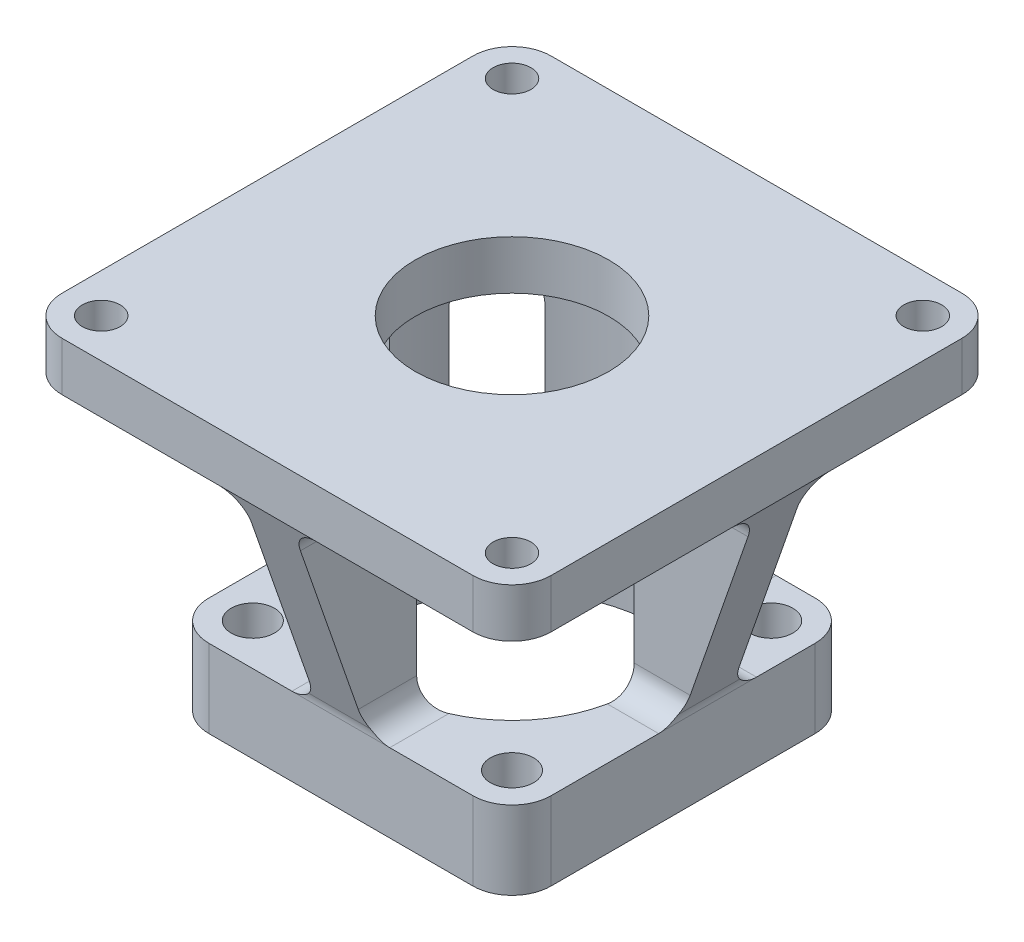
from build123d import *

# Parameters (mm, degrees)
SKETCH1_W                      = 63.5
SKETCH1_H                      = 63.5
SKETCH1_R                      = 15.875
BOSS_EXTRUDE1_DEPTH            = 44.45
F_2_0_221_DIAMETER_HOLE1_D     = 5.6134
F_2_0_221_DIAMETER_HOLE1_DEPTH = 12.7
F_2_0_221_DIAMETER_HOLE1_TIP   = 1.686435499
SKETCH7_W                      = 28.575
SKETCH7_H                      = 27.94
CUT_EXTRUDE1_DEPTH             = 31.74746
FILLET1_R                      = 3.175
FILLET1_OF_MIRROR1_R           = 3.175
SKETCH14_W                     = 22.86
SKETCH14_H                     = 27.94
CUT_EXTRUDE8_DEPTH             = 25.40254
FILLET5_R                      = 3.175
FILLET5_OF_MIRROR4_R           = 3.175
CUT_EXTRUDE7_DEPTH             = 84.762253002
CIRPATTERN1_COUNT              = 4
FILLET6_R                      = 5.08
SKETCH16_R                     = 19.0627
SKETCH16_R_2                   = 15.875
CUT_EXTRUDE10_DEPTH            = 7.62
BOSS_EXTRUDE2_START            = -6.35
SKETCH17_R                     = 15.875
SKETCH17_R_2                   = 12.5635
BOSS_EXTRUDE2_DEPTH            = 6.35
F_10_0_1935_DIAMETER_HOLE1_D   = 4.9149


with BuildPart() as part:
    # Sketch1 → Boss-Extrude1 (new body)
    with BuildSketch(Plane(origin=(0, 0, 0), x_dir=(1, 0, 0), z_dir=(0, 1, 0))):
        Rectangle(SKETCH1_W, SKETCH1_H)
        with Locations(Location((0, 0, 0), (0, 0, 270))):
            Circle(SKETCH1_R, mode=Mode.SUBTRACT)
    extrude(amount=BOSS_EXTRUDE1_DEPTH)

    # 2 _0.221_ Diameter Hole1
    with Locations(Plane(origin=(0, 0, 0), x_dir=(-1, 0, 0), z_dir=(0, -1, 0))):
        with Locations((16.8275, 16.8275), (-16.8275, 16.8275), (-16.8275, -16.8275), (0, 0), (16.8275, -16.8275)):
            Hole(F_2_0_221_DIAMETER_HOLE1_D / 2, depth=F_2_0_221_DIAMETER_HOLE1_DEPTH)
            with Locations((0, 0, -(F_2_0_221_DIAMETER_HOLE1_DEPTH + F_2_0_221_DIAMETER_HOLE1_TIP / 2))):  # 118° drill point
                Cone(0, F_2_0_221_DIAMETER_HOLE1_D / 2, F_2_0_221_DIAMETER_HOLE1_TIP, mode=Mode.SUBTRACT)

    # Sketch7 → Cut-Extrude1 (cut)
    with BuildSketch(Plane.XY.offset(31.75)):
        with Locations((-17.4625, 24.13)):
            Rectangle(SKETCH7_W, SKETCH7_H)
    cut_extrude1 = extrude(amount=-CUT_EXTRUDE1_DEPTH, mode=Mode.SUBTRACT)

    # Fillet1
    fillet1_edges = [part.edges().sort_by_distance(p)[0] for p in [
        (-3.175, 10.16, 23.652129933),
        (-3.175, 38.1, 23.652129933),
        (-23.812499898, 38.1, 0.00254),
        (-23.812499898, 10.16, 0.00254),
    ]]
    fillet(fillet1_edges, radius=FILLET1_R)

    # Mirror1: Cut-Extrude1 across plane
    add(cut_extrude1.mirror(Plane(origin=(0, 0, 0), x_dir=(0, 0, 1), z_dir=(1, 0, 0))), mode=Mode.SUBTRACT)

    # Fillet1 of Mirror1
    fillet1_of_mirror1_edges = [part.edges().sort_by_distance(p)[0] for p in [
        (3.175, 10.16, 23.652129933),
        (3.175, 38.1, 23.652129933),
        (23.812499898, 38.1, 0.00254),
        (23.812499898, 10.16, 0.00254),
    ]]
    fillet(fillet1_of_mirror1_edges, radius=FILLET1_OF_MIRROR1_R)

    # Sketch14 → Cut-Extrude8 (cut)
    with BuildSketch(Plane(origin=(0, 0, -31.75), x_dir=(-1, 0, 0), z_dir=(0, 0, -1))):
        with Locations((20.32, 24.13)):
            Rectangle(SKETCH14_W, SKETCH14_H)
    cut_extrude8 = extrude(amount=-CUT_EXTRUDE8_DEPTH, mode=Mode.SUBTRACT)

    # Fillet5
    fillet5_edges = [part.edges().sort_by_distance(p)[0] for p in [
        (-23.150393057, 10.16, -6.34746),
        (-8.89, 38.1, -22.451160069),
        (-23.150393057, 38.1, -6.34746),
        (-8.89, 10.16, -22.451160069),
    ]]
    fillet(fillet5_edges, radius=FILLET5_R)

    # Mirror4: Cut-Extrude8 across plane
    add(cut_extrude8.mirror(Plane(origin=(0, 0, 0), x_dir=(0, 0, 1), z_dir=(1, 0, 0))), mode=Mode.SUBTRACT)

    # Fillet5 of Mirror4
    fillet5_of_mirror4_edges = [part.edges().sort_by_distance(p)[0] for p in [
        (23.150393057, 10.16, -6.34746),
        (8.89, 38.1, -22.451160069),
        (23.150393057, 38.1, -6.34746),
        (8.89, 10.16, -22.451160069),
    ]]
    fillet(fillet5_of_mirror4_edges, radius=FILLET5_OF_MIRROR4_R)

    # Sketch13 → Cut-Extrude7 (cut, through all)
    with BuildSketch(Plane.XY.offset(31.75)):
        with BuildLine():
            Line((-31.75, 38.1), (-22.400991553, 11.202388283))
            ThreePointArc((-22.400991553, 11.202388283), (-22.26930704, 10.688570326), (-22.225, 10.16))
            Line((-22.225, 10.16), (-22.225, 0))
            Line((-22.225, 0), (-31.75, 0))
            Line((-31.75, 0), (-31.75, 38.1))
        make_face()
    cut_extrude7 = extrude(amount=-CUT_EXTRUDE7_DEPTH, mode=Mode.SUBTRACT)

    # CirPattern1: Cut-Extrude7 ×4 about axis
    cirpattern1_axis = Axis((0, 0, 0), (0, 1, 0))
    for i in range(1, CIRPATTERN1_COUNT):
        add(cut_extrude7.rotate(cirpattern1_axis, i * 360 / CIRPATTERN1_COUNT), mode=Mode.SUBTRACT)

    # Fillet6
    fillet6_edges = [part.edges().sort_by_distance(p)[0] for p in [
        (-22.225, 5.08, 22.225),
        (-22.225, 5.08, -22.225),
        (22.225, 5.08, 22.225),
        (22.225, 5.08, -22.225),
        (-31.75, 41.275, -31.75),
        (31.75, 41.275, -31.75),
        (31.75, 41.275, 31.75),
        (-31.75, 41.275, 31.75),
    ]]
    fillet(fillet6_edges, radius=FILLET6_R)

    # Sketch16 → Cut-Extrude10 (cut)
    with BuildSketch(Plane.XZ):
        with Locations(Location((0, 0, 0), (0, 0, 270))):
            Circle(SKETCH16_R)
        with Locations(Location((0, 0, 0), (0, 0, 270))):
            Circle(SKETCH16_R_2, mode=Mode.SUBTRACT)
    extrude(amount=-CUT_EXTRUDE10_DEPTH, mode=Mode.SUBTRACT)

    # Sketch17 → Boss-Extrude2 (add)
    with BuildSketch(Plane(origin=(0, 44.45, 0), x_dir=(1, 0, 0), z_dir=(0, 1, 0)).offset(BOSS_EXTRUDE2_START)):
        with Locations(Location((0, 0, 0), (0, 0, 90))):
            Circle(SKETCH17_R)
        with Locations(Location((0, 0, 0), (0, 0, 270))):
            Circle(SKETCH17_R_2, mode=Mode.SUBTRACT)
    extrude(amount=BOSS_EXTRUDE2_DEPTH)

    # 10 _0.1935_ Diameter Hole1 (through all)
    with Locations(Plane(origin=(0, 44.45, 0), x_dir=(1, 0, 0), z_dir=(0, 1, 0))):
        with Locations((-26.67, 26.67), (26.67, 26.67), (26.67, -26.67), (-26.67, -26.67)):
            Hole(F_10_0_1935_DIAMETER_HOLE1_D / 2)


solid = part.part
